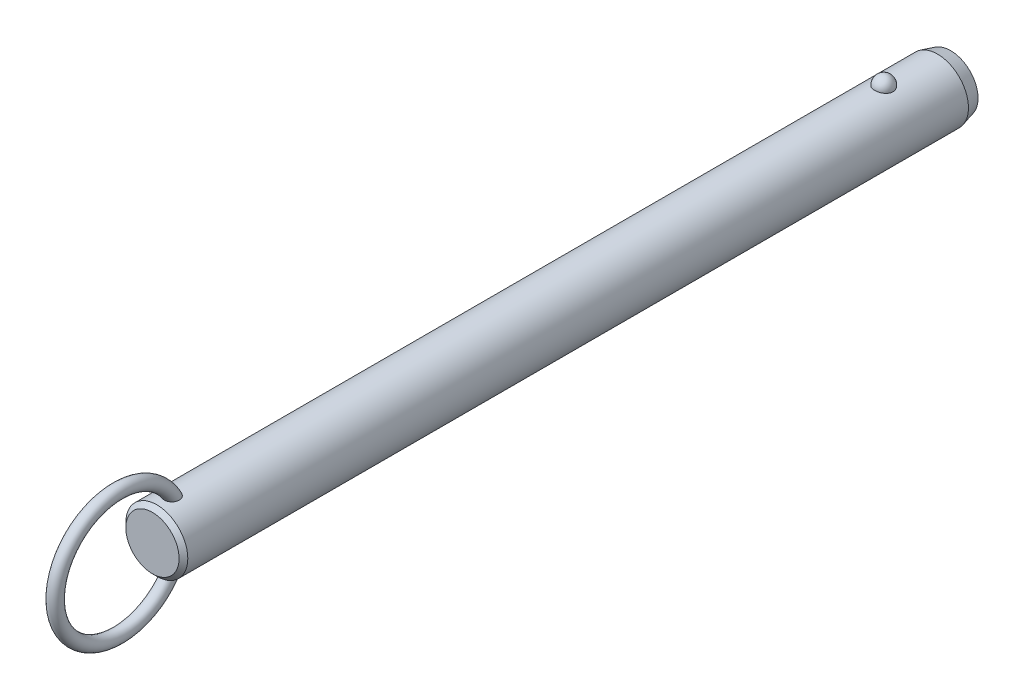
ISO-10303-21;
HEADER;
FILE_DESCRIPTION(('STEP AP214'),'2;1');
FILE_NAME('part.step','',(''),(''),'','','');
FILE_SCHEMA(('AUTOMOTIVE_DESIGN { 1 0 10303 214 1 1 1 1 }'));
ENDSEC;
DATA;
#1=APPLICATION_CONTEXT('core data for automotive mechanical design processes');
#2=APPLICATION_PROTOCOL_DEFINITION('international standard','automotive_design',2000,#1);
#3=PRODUCT_CONTEXT('',#1,'mechanical');
#4=PRODUCT('Part','Part','',(#3));
#5=PRODUCT_RELATED_PRODUCT_CATEGORY('part','',(#4));
#6=PRODUCT_DEFINITION_FORMATION('','',#4);
#7=PRODUCT_DEFINITION_CONTEXT('part definition',#1,'design');
#8=PRODUCT_DEFINITION('design','',#6,#7);
#9=PRODUCT_DEFINITION_SHAPE('','',#8);
#10=(LENGTH_UNIT() NAMED_UNIT(*) SI_UNIT(.MILLI.,.METRE.));
#11=(NAMED_UNIT(*) PLANE_ANGLE_UNIT() SI_UNIT($,.RADIAN.));
#12=(NAMED_UNIT(*) SI_UNIT($,.STERADIAN.) SOLID_ANGLE_UNIT());
#13=UNCERTAINTY_MEASURE_WITH_UNIT(LENGTH_MEASURE(1.E-05),#10,'distance_accuracy_value','');
#14=(GEOMETRIC_REPRESENTATION_CONTEXT(3) GLOBAL_UNCERTAINTY_ASSIGNED_CONTEXT((#13)) GLOBAL_UNIT_ASSIGNED_CONTEXT((#10,
#11,#12)) REPRESENTATION_CONTEXT('',''));
#15=CARTESIAN_POINT('',(0.,0.,0.));
#16=DIRECTION('',(0.,0.,1.));
#17=DIRECTION('',(1.,0.,0.));
#18=AXIS2_PLACEMENT_3D('',#15,#16,#17);
#19=CARTESIAN_POINT('',(0.,0.,157.5));
#20=DIRECTION('',(0.,0.,-1.));
#21=DIRECTION('',(-1.,0.,0.));
#22=AXIS2_PLACEMENT_3D('',#19,#20,#21);
#23=CYLINDRICAL_SURFACE('',#22,7.1);
#24=CARTESIAN_POINT('',(2.0769088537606,6.78943661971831,-2.1));
#25=CARTESIAN_POINT('',(2.07690739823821,6.78943796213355,-1.98268154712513));
#26=CARTESIAN_POINT('',(2.06738130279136,6.79237331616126,-1.86534506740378));
#27=CARTESIAN_POINT('',(2.0295040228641,6.8037853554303,-1.63400788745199));
#28=CARTESIAN_POINT('',(2.00114757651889,6.81226358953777,-1.52000812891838));
#29=CARTESIAN_POINT('',(1.92632025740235,6.83379798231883,-1.29863433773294));
#30=CARTESIAN_POINT('',(1.87985726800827,6.84685214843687,-1.19125744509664));
#31=CARTESIAN_POINT('',(1.76995205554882,6.87608091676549,-0.98604657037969));
#32=CARTESIAN_POINT('',(1.70650980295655,6.8922555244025,-0.88821260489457));
#33=CARTESIAN_POINT('',(1.5638119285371,6.92602930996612,-0.704242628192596));
#34=CARTESIAN_POINT('',(1.4844714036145,6.94363582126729,-0.618173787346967));
#35=CARTESIAN_POINT('',(1.31221746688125,6.97823658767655,-0.460740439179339));
#36=CARTESIAN_POINT('',(1.21930409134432,6.99523084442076,-0.389375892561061));
#37=CARTESIAN_POINT('',(1.02268781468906,7.02666176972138,-0.263547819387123));
#38=CARTESIAN_POINT('',(0.91902009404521,7.04110638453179,-0.209031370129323));
#39=CARTESIAN_POINT('',(0.703548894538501,7.06588726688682,-0.118163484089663));
#40=CARTESIAN_POINT('',(0.591746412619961,7.07622403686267,-0.0818098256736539));
#41=CARTESIAN_POINT('',(0.365557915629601,7.09147068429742,-0.0288711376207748));
#42=CARTESIAN_POINT('',(0.251267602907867,7.09648447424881,-0.0119070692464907));
#43=CARTESIAN_POINT('',(0.0213499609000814,7.10089837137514,0.00304925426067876));
#44=CARTESIAN_POINT('',(-0.0942772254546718,7.10029907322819,0.00104351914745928));
#45=CARTESIAN_POINT('',(-0.321651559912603,7.09360829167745,-0.0216931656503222));
#46=CARTESIAN_POINT('',(-0.433431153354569,7.08760388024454,-0.0421272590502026));
#47=CARTESIAN_POINT('',(-0.651862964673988,7.07086131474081,-0.100729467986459));
#48=CARTESIAN_POINT('',(-0.758515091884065,7.06012307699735,-0.138897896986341));
#49=CARTESIAN_POINT('',(-0.964449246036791,7.03496097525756,-0.232213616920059));
#50=CARTESIAN_POINT('',(-1.06368095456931,7.02051445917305,-0.287465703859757));
#51=CARTESIAN_POINT('',(-1.25145353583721,6.98948740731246,-0.413383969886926));
#52=CARTESIAN_POINT('',(-1.33999321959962,6.97290663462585,-0.48405186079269));
#53=CARTESIAN_POINT('',(-1.50591604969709,6.93898770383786,-0.640594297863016));
#54=CARTESIAN_POINT('',(-1.58302488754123,6.92164094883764,-0.726757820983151));
#55=CARTESIAN_POINT('',(-1.72189320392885,6.8884103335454,-0.91092752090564));
#56=CARTESIAN_POINT('',(-1.78365144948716,6.87252659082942,-1.008934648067));
#57=CARTESIAN_POINT('',(-1.89101272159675,6.84377189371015,-1.21549497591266));
#58=CARTESIAN_POINT('',(-1.93639553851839,6.83094274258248,-1.32416860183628));
#59=CARTESIAN_POINT('',(-2.00874275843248,6.81002070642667,-1.54791500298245));
#60=CARTESIAN_POINT('',(-2.03570774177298,6.80192767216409,-1.66298757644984));
#61=CARTESIAN_POINT('',(-2.07047276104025,6.7914266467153,-1.89571453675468));
#62=CARTESIAN_POINT('',(-2.07835878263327,6.78899315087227,-2.01335491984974));
#63=CARTESIAN_POINT('',(-2.07502083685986,6.79001409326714,-2.24833570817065));
#64=CARTESIAN_POINT('',(-2.06379746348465,6.7934683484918,-2.36567612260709));
#65=CARTESIAN_POINT('',(-2.02263913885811,6.80583442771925,-2.59603194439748));
#66=CARTESIAN_POINT('',(-1.99281127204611,6.81471501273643,-2.70906820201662));
#67=CARTESIAN_POINT('',(-1.91526639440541,6.83691232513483,-2.92836575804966));
#68=CARTESIAN_POINT('',(-1.8675486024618,6.85022924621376,-3.03462676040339));
#69=CARTESIAN_POINT('',(-1.75504492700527,6.87991336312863,-3.23806487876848));
#70=CARTESIAN_POINT('',(-1.69015924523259,6.89629822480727,-3.33518422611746));
#71=CARTESIAN_POINT('',(-1.54505404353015,6.93024852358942,-3.51697105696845));
#72=CARTESIAN_POINT('',(-1.46483385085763,6.94781401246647,-3.60163799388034));
#73=CARTESIAN_POINT('',(-1.29071406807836,6.98225977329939,-3.75654119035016));
#74=CARTESIAN_POINT('',(-1.19675650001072,6.99913673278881,-3.82671308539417));
#75=CARTESIAN_POINT('',(-0.997940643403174,7.03023618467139,-3.9501837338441));
#76=CARTESIAN_POINT('',(-0.89308318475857,7.04445887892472,-4.00348377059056));
#77=CARTESIAN_POINT('',(-0.676902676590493,7.06848365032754,-4.09107242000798));
#78=CARTESIAN_POINT('',(-0.565686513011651,7.0783430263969,-4.12560889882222));
#79=CARTESIAN_POINT('',(-0.338739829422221,7.09282534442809,-4.17575450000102));
#80=CARTESIAN_POINT('',(-0.223009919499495,7.09744899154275,-4.19136617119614));
#81=CARTESIAN_POINT('',(0.00707628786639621,7.10090930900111,-4.20307965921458));
#82=CARTESIAN_POINT('',(0.121410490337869,7.09986531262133,-4.19958377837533));
#83=CARTESIAN_POINT('',(0.347815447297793,7.092380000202,-4.17411564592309));
#84=CARTESIAN_POINT('',(0.459886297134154,7.08593891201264,-4.15214417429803));
#85=CARTESIAN_POINT('',(0.678084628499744,7.06838983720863,-4.09049562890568));
#86=CARTESIAN_POINT('',(0.784237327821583,7.05730369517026,-4.05090137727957));
#87=CARTESIAN_POINT('',(0.988305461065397,7.03163139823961,-3.95511447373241));
#88=CARTESIAN_POINT('',(1.08622031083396,7.01704499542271,-3.89892064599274));
#89=CARTESIAN_POINT('',(1.27284490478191,6.98562668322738,-3.77035541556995));
#90=CARTESIAN_POINT('',(1.36137372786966,6.96876135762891,-3.69772964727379));
#91=CARTESIAN_POINT('',(1.52509486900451,6.93477412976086,-3.53878279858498));
#92=CARTESIAN_POINT('',(1.60028496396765,6.91765218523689,-3.45245943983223));
#93=CARTESIAN_POINT('',(1.73681688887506,6.88465753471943,-3.26658774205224));
#94=CARTESIAN_POINT('',(1.79785966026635,6.86881574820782,-3.16681408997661));
#95=CARTESIAN_POINT('',(1.90265327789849,6.84053157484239,-2.95814408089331));
#96=CARTESIAN_POINT('',(1.94640861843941,6.82808830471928,-2.84925010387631));
#97=CARTESIAN_POINT('',(2.01274378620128,6.80881460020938,-2.63454318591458));
#98=CARTESIAN_POINT('',(2.03676193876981,6.80160856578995,-2.52920574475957));
#99=CARTESIAN_POINT('',(2.06884490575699,6.79191902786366,-2.3159172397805));
#100=CARTESIAN_POINT('',(2.07691019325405,6.78943538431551,-2.20796625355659));
#101=CARTESIAN_POINT('',(2.0769088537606,6.78943661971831,-2.1));
#102=B_SPLINE_CURVE_WITH_KNOTS('',3,(#24,#25,#26,#27,#28,#29,#30,#31,#32,#33,#34,#35,#36,#37,
#38,#39,#40,#41,#42,#43,#44,#45,#46,#47,#48,#49,#50,#51,#52,#53,#54,#55,#56,#57,#58,#59,#60,#61,
#62,#63,#64,#65,#66,#67,#68,#69,#70,#71,#72,#73,#74,#75,#76,#77,#78,#79,#80,#81,#82,#83,#84,#85,
#86,#87,#88,#89,#90,#91,#92,#93,#94,#95,#96,#97,#98,#99,#100,#101),.UNSPECIFIED.,.T.,.F.,(4,2,2,
2,2,2,2,2,2,2,2,2,2,2,2,2,2,2,2,2,2,2,2,2,2,2,2,2,2,2,2,2,2,2,2,2,2,2,4),(0.,0.351568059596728,
0.703234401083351,1.05474780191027,1.40626181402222,1.75970563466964,2.11314851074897,
2.4654696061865,2.81774759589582,3.16301449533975,3.50824481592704,3.84801136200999,
4.18778391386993,4.52968352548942,4.87162112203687,5.22076181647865,5.56993054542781,
5.92363364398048,6.27732559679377,6.62942052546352,6.98150450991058,7.33158042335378,
7.68167162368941,8.03384443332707,8.38603269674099,8.73975272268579,9.09344583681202,
9.44234545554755,9.79119807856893,10.1327344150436,10.4742563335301,10.8141898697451,
11.1541474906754,11.4997793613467,11.8454687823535,12.1979079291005,12.5502553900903,
12.8738073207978,13.1973496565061),.UNSPECIFIED.);
#103=CARTESIAN_POINT('',(2.0769088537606,6.78943661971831,-2.1));
#104=VERTEX_POINT('',#103);
#105=EDGE_CURVE('E41',#104,#104,#102,.T.);
#106=ORIENTED_EDGE('',*,*,#105,.T.);
#107=EDGE_LOOP('',(#106));
#108=FACE_BOUND('',#107,.T.);
#109=CARTESIAN_POINT('',(0.,0.,164.42));
#110=DIRECTION('',(0.,0.,1.));
#111=DIRECTION('',(1.,0.,0.));
#112=AXIS2_PLACEMENT_3D('',#109,#110,#111);
#113=CIRCLE('',#112,7.1);
#114=CARTESIAN_POINT('',(7.1,0.,164.42));
#115=VERTEX_POINT('',#114);
#116=EDGE_CURVE('E10',#115,#115,#113,.F.);
#117=ORIENTED_EDGE('',*,*,#116,.T.);
#118=EDGE_LOOP('',(#117));
#119=FACE_BOUND('',#118,.T.);
#120=CARTESIAN_POINT('',(-0.429539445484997,-7.08699541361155,159.242921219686));
#121=CARTESIAN_POINT('',(-0.508331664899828,-7.08221999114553,159.266876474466));
#122=CARTESIAN_POINT('',(-0.585039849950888,-7.07624016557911,159.297457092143));
#123=CARTESIAN_POINT('',(-0.73208265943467,-7.06254296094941,159.371024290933));
#124=CARTESIAN_POINT('',(-0.802417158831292,-7.05482554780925,159.414011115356));
#125=CARTESIAN_POINT('',(-0.934722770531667,-7.03851844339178,159.511113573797));
#126=CARTESIAN_POINT('',(-0.996700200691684,-7.02992941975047,159.565220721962));
#127=CARTESIAN_POINT('',(-1.11079942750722,-7.01280697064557,159.682967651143));
#128=CARTESIAN_POINT('',(-1.16292136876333,-7.00427354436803,159.746607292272));
#129=CARTESIAN_POINT('',(-1.25705660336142,-6.98799959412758,159.882687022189));
#130=CARTESIAN_POINT('',(-1.29888032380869,-6.98027525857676,159.955259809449));
#131=CARTESIAN_POINT('',(-1.37069920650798,-6.96652886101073,160.106168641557));
#132=CARTESIAN_POINT('',(-1.40069157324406,-6.96050720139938,160.184506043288));
#133=CARTESIAN_POINT('',(-1.45043507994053,-6.95031881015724,160.350190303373));
#134=CARTESIAN_POINT('',(-1.46937115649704,-6.94630231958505,160.437789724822));
#135=CARTESIAN_POINT('',(-1.49424917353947,-6.94099239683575,160.614871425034));
#136=CARTESIAN_POINT('',(-1.50018601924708,-6.93970003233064,160.704354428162));
#137=CARTESIAN_POINT('',(-1.49978214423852,-6.93978815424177,160.894060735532));
#138=CARTESIAN_POINT('',(-1.49187639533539,-6.94150934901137,160.994279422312));
#139=CARTESIAN_POINT('',(-1.46177925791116,-6.94790814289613,161.192479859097));
#140=CARTESIAN_POINT('',(-1.43957541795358,-6.95258831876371,161.290459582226));
#141=CARTESIAN_POINT('',(-1.37783293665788,-6.96510647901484,161.49536292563));
#142=CARTESIAN_POINT('',(-1.33634073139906,-6.97328848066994,161.601680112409));
#143=CARTESIAN_POINT('',(-1.23686994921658,-6.99161706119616,161.806177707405));
#144=CARTESIAN_POINT('',(-1.17889192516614,-7.00176357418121,161.904358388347));
#145=CARTESIAN_POINT('',(-1.05875124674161,-7.02082898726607,162.072374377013));
#146=CARTESIAN_POINT('',(-0.999247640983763,-7.02963746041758,162.144123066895));
#147=CARTESIAN_POINT('',(-0.869494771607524,-7.04686074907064,162.277195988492));
#148=CARTESIAN_POINT('',(-0.799263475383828,-7.05527619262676,162.338537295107));
#149=CARTESIAN_POINT('',(-0.665408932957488,-7.06899457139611,162.435131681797));
#150=CARTESIAN_POINT('',(-0.603817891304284,-7.07457275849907,162.473151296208));
#151=CARTESIAN_POINT('',(-0.475172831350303,-7.08437420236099,162.538758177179));
#152=CARTESIAN_POINT('',(-0.408123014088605,-7.08859848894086,162.566353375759));
#153=CARTESIAN_POINT('',(-0.269431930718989,-7.09522749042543,162.609256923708));
#154=CARTESIAN_POINT('',(-0.197757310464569,-7.09761688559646,162.624461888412));
#155=CARTESIAN_POINT('',(-0.0527849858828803,-7.10017268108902,162.640716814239));
#156=CARTESIAN_POINT('',(0.0205115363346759,-7.10034065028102,162.641776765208));
#157=CARTESIAN_POINT('',(0.156426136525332,-7.09855986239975,162.630461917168));
#158=CARTESIAN_POINT('',(0.219199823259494,-7.09688191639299,162.619806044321));
#159=CARTESIAN_POINT('',(0.342134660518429,-7.09201880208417,162.588537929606));
#160=CARTESIAN_POINT('',(0.402295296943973,-7.08883333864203,162.567923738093));
#161=CARTESIAN_POINT('',(0.520687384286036,-7.08113868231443,162.517212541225));
#162=CARTESIAN_POINT('',(0.578791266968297,-7.07658958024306,162.486827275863));
#163=CARTESIAN_POINT('',(0.690173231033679,-7.06659708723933,162.418367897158));
#164=CARTESIAN_POINT('',(0.743447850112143,-7.061153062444,162.380288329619));
#165=CARTESIAN_POINT('',(0.870947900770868,-7.04680292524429,162.276592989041));
#166=CARTESIAN_POINT('',(0.941828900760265,-7.03755800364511,162.206897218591));
#167=CARTESIAN_POINT('',(1.07136606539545,-7.01900793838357,162.056945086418));
#168=CARTESIAN_POINT('',(1.13000013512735,-7.00970271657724,161.976670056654));
#169=CARTESIAN_POINT('',(1.23579584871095,-6.99183327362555,161.806899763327));
#170=CARTESIAN_POINT('',(1.28274271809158,-6.98328455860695,161.717269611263));
#171=CARTESIAN_POINT('',(1.36351442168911,-6.96796352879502,161.532176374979));
#172=CARTESIAN_POINT('',(1.39733971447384,-6.96119115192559,161.436713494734));
#173=CARTESIAN_POINT('',(1.45579181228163,-6.94922464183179,161.22530928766));
#174=CARTESIAN_POINT('',(1.47790145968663,-6.94449000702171,161.108631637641));
#175=CARTESIAN_POINT('',(1.50168752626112,-6.93938731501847,160.873015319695));
#176=CARTESIAN_POINT('',(1.50336085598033,-6.93901991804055,160.75407631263));
#177=CARTESIAN_POINT('',(1.48486516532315,-6.9430010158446,160.52360799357));
#178=CARTESIAN_POINT('',(1.46573441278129,-6.9471253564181,160.411995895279));
#179=CARTESIAN_POINT('',(1.40606892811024,-6.95944667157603,160.194886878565));
#180=CARTESIAN_POINT('',(1.36556446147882,-6.96763788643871,160.0893815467));
#181=CARTESIAN_POINT('',(1.2708270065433,-6.98548038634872,159.904287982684));
#182=CARTESIAN_POINT('',(1.21949810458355,-6.99473841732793,159.823171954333));
#183=CARTESIAN_POINT('',(1.10242050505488,-7.01414069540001,159.672227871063));
#184=CARTESIAN_POINT('',(1.03668119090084,-7.02428436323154,159.60239252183));
#185=CARTESIAN_POINT('',(0.900559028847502,-7.04295285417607,159.483573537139));
#186=CARTESIAN_POINT('',(0.831428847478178,-7.05153466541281,159.433157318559));
#187=CARTESIAN_POINT('',(0.685291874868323,-7.06723150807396,159.345142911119));
#188=CARTESIAN_POINT('',(0.608287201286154,-7.07434693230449,159.307541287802));
#189=CARTESIAN_POINT('',(0.451878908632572,-7.08602232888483,159.247491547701));
#190=CARTESIAN_POINT('',(0.372686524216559,-7.09067127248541,159.224508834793));
#191=CARTESIAN_POINT('',(0.21147739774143,-7.09730788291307,159.192035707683));
#192=CARTESIAN_POINT('',(0.129460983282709,-7.09929585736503,159.18254373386));
#193=CARTESIAN_POINT('',(-0.0332905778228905,-7.10037858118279,159.177351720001));
#194=CARTESIAN_POINT('',(-0.114016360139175,-7.09953334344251,159.181365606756));
#195=CARTESIAN_POINT('',(-0.273670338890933,-7.09517338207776,159.202454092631));
#196=CARTESIAN_POINT('',(-0.352598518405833,-7.09165863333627,159.219528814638));
#197=CARTESIAN_POINT('',(-0.429539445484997,-7.08699541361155,159.242921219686));
#198=B_SPLINE_CURVE_WITH_KNOTS('',3,(#120,#121,#122,#123,#124,#125,#126,#127,#128,#129,#130,
#131,#132,#133,#134,#135,#136,#137,#138,#139,#140,#141,#142,#143,#144,#145,#146,#147,#148,#149,
#150,#151,#152,#153,#154,#155,#156,#157,#158,#159,#160,#161,#162,#163,#164,#165,#166,#167,#168,
#169,#170,#171,#172,#173,#174,#175,#176,#177,#178,#179,#180,#181,#182,#183,#184,#185,#186,#187,
#188,#189,#190,#191,#192,#193,#194,#195,#196,#197),.UNSPECIFIED.,.T.,.F.,(4,2,2,2,2,2,2,2,2,2,2,
2,2,2,2,2,2,2,2,2,2,2,2,2,2,2,2,2,2,2,2,2,2,2,2,2,2,2,4),(0.,0.247183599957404,
0.494372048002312,0.741372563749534,0.988369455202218,1.23962059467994,1.490931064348,
1.75897818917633,2.02713035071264,2.32758265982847,2.62829697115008,2.97008736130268,
3.31186629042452,3.59175319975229,3.87117637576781,4.08813841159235,4.30493502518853,
4.5235225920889,4.74195577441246,4.93215328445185,5.12238804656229,5.31884850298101,
5.51544871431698,5.81332317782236,6.11173048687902,6.41527266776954,6.71880423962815,
7.07358156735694,7.42841252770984,7.76631485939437,8.10373999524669,8.39142246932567,
8.67891817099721,8.93560332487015,9.19221962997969,9.43881106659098,9.68537399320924,
9.92674752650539,10.1681233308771),.UNSPECIFIED.);
#199=CARTESIAN_POINT('',(-0.429539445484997,-7.08699541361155,159.242921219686));
#200=VERTEX_POINT('',#199);
#201=EDGE_CURVE('E59',#200,#200,#198,.T.);
#202=ORIENTED_EDGE('',*,*,#201,.T.);
#203=EDGE_LOOP('',(#202));
#204=FACE_BOUND('',#203,.T.);
#205=CARTESIAN_POINT('',(-0.429539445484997,7.08699541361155,159.242921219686));
#206=CARTESIAN_POINT('',(-0.351665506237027,7.09171429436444,159.219246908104));
#207=CARTESIAN_POINT('',(-0.271733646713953,7.09525896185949,159.202036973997));
#208=CARTESIAN_POINT('',(-0.110026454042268,7.09960839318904,159.181005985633));
#209=CARTESIAN_POINT('',(-0.0282502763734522,7.10041187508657,159.177191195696));
#210=CARTESIAN_POINT('',(0.134782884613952,7.09918849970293,159.183059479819));
#211=CARTESIAN_POINT('',(0.216039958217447,7.09716214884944,159.19274013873));
#212=CARTESIAN_POINT('',(0.375730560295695,7.09050177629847,159.225347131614));
#213=CARTESIAN_POINT('',(0.454164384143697,7.08586802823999,159.248272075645));
#214=CARTESIAN_POINT('',(0.606025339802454,7.07449911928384,159.306771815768));
#215=CARTESIAN_POINT('',(0.67945100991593,7.06776334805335,159.342350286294));
#216=CARTESIAN_POINT('',(0.819234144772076,7.05292866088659,159.425175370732));
#217=CARTESIAN_POINT('',(0.88559181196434,7.04482978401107,159.472421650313));
#218=CARTESIAN_POINT('',(1.00993211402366,7.02808709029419,159.577590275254));
#219=CARTESIAN_POINT('',(1.06785399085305,7.01943990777,159.635583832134));
#220=CARTESIAN_POINT('',(1.17342527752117,7.00256662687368,159.760301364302));
#221=CARTESIAN_POINT('',(1.22107408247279,6.99434055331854,159.827025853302));
#222=CARTESIAN_POINT('',(1.30652927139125,6.97889183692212,159.969362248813));
#223=CARTESIAN_POINT('',(1.34399711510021,6.97170674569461,160.045180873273));
#224=CARTESIAN_POINT('',(1.40682616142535,6.95930080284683,160.201810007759));
#225=CARTESIAN_POINT('',(1.43218374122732,6.95408053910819,160.28262200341));
#226=CARTESIAN_POINT('',(1.47246409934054,6.94566853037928,160.453531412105));
#227=CARTESIAN_POINT('',(1.48642590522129,6.9426653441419,160.54386307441));
#228=CARTESIAN_POINT('',(1.5011410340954,6.93949744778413,160.725619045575));
#229=CARTESIAN_POINT('',(1.50188917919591,6.93933385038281,160.817043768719));
#230=CARTESIAN_POINT('',(1.49030464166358,6.94183245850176,161.01084381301));
#231=CARTESIAN_POINT('',(1.47627413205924,6.94486147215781,161.113112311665));
#232=CARTESIAN_POINT('',(1.43356351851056,6.95380194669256,161.314471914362));
#233=CARTESIAN_POINT('',(1.4048676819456,6.95971650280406,161.413559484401));
#234=CARTESIAN_POINT('',(1.32908750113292,6.97461208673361,161.618908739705));
#235=CARTESIAN_POINT('',(1.28011435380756,6.98388945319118,161.724456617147));
#236=CARTESIAN_POINT('',(1.16520357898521,7.00397743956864,161.925760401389));
#237=CARTESIAN_POINT('',(1.09927694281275,7.01478706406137,162.021522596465));
#238=CARTESIAN_POINT('',(0.969361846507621,7.03373936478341,162.176756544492));
#239=CARTESIAN_POINT('',(0.909042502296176,7.04187023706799,162.239303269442));
#240=CARTESIAN_POINT('',(0.779178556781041,7.05741732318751,162.354053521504));
#241=CARTESIAN_POINT('',(0.709649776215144,7.06483472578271,162.406274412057));
#242=CARTESIAN_POINT('',(0.576854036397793,7.0767751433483,162.488113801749));
#243=CARTESIAN_POINT('',(0.515118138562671,7.08158033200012,162.520164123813));
#244=CARTESIAN_POINT('',(0.387127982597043,7.08972701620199,162.573765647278));
#245=CARTESIAN_POINT('',(0.320877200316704,7.09306962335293,162.595324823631));
#246=CARTESIAN_POINT('',(0.185041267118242,7.09791507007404,162.626400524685));
#247=CARTESIAN_POINT('',(0.115437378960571,7.09940591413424,162.635838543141));
#248=CARTESIAN_POINT('',(-0.0243157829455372,7.10030171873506,162.641522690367));
#249=CARTESIAN_POINT('',(-0.0944648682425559,7.0997073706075,162.637773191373));
#250=CARTESIAN_POINT('',(-0.225713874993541,7.09668414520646,162.618508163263));
#251=CARTESIAN_POINT('',(-0.287006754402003,7.09444865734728,162.604232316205));
#252=CARTESIAN_POINT('',(-0.406555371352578,7.08860360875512,162.566368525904));
#253=CARTESIAN_POINT('',(-0.464809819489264,7.08499346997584,162.542776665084));
#254=CARTESIAN_POINT('',(-0.594955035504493,7.07541654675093,162.478923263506));
#255=CARTESIAN_POINT('',(-0.665389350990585,7.06906574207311,162.435753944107));
#256=CARTESIAN_POINT('',(-0.798242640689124,7.05530261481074,162.338587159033));
#257=CARTESIAN_POINT('',(-0.860645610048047,7.0478882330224,162.284568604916));
#258=CARTESIAN_POINT('',(-0.994249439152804,7.03045217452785,162.150996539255));
#259=CARTESIAN_POINT('',(-1.06260129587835,7.02030745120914,162.068614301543));
#260=CARTESIAN_POINT('',(-1.18502045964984,7.00068382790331,161.893843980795));
#261=CARTESIAN_POINT('',(-1.23907684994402,6.99120544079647,161.801448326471));
#262=CARTESIAN_POINT('',(-1.33335589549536,6.97384343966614,161.608008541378));
#263=CARTESIAN_POINT('',(-1.37336138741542,6.96598557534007,161.506856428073));
#264=CARTESIAN_POINT('',(-1.43770677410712,6.95299053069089,161.299504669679));
#265=CARTESIAN_POINT('',(-1.46204473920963,6.94785368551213,161.19330440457));
#266=CARTESIAN_POINT('',(-1.49537533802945,6.94076296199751,160.968231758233));
#267=CARTESIAN_POINT('',(-1.50273564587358,6.93914842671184,160.84909751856));
#268=CARTESIAN_POINT('',(-1.4954555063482,6.94072368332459,160.611470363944));
#269=CARTESIAN_POINT('',(-1.48082914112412,6.94391040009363,160.492977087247));
#270=CARTESIAN_POINT('',(-1.43076401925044,6.95438579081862,160.273432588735));
#271=CARTESIAN_POINT('',(-1.3976222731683,6.96121852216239,160.171841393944));
#272=CARTESIAN_POINT('',(-1.31211274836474,6.97783941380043,159.977351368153));
#273=CARTESIAN_POINT('',(-1.25976607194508,6.98762432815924,159.88444313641));
#274=CARTESIAN_POINT('',(-1.14583073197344,7.00713153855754,159.724160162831));
#275=CARTESIAN_POINT('',(-1.08665947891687,7.01665982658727,159.655035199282));
#276=CARTESIAN_POINT('',(-0.95660664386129,7.03556646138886,159.528878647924));
#277=CARTESIAN_POINT('',(-0.885737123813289,7.04494495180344,159.471834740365));
#278=CARTESIAN_POINT('',(-0.751558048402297,7.06035735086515,159.383100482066));
#279=CARTESIAN_POINT('',(-0.69012057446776,7.0666695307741,159.348593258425));
#280=CARTESIAN_POINT('',(-0.562815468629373,7.07794609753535,159.288750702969));
#281=CARTESIAN_POINT('',(-0.496948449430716,7.08291067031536,159.263414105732));
#282=CARTESIAN_POINT('',(-0.429539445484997,7.08699541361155,159.242921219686));
#283=B_SPLINE_CURVE_WITH_KNOTS('',3,(#205,#206,#207,#208,#209,#210,#211,#212,#213,#214,#215,
#216,#217,#218,#219,#220,#221,#222,#223,#224,#225,#226,#227,#228,#229,#230,#231,#232,#233,#234,
#235,#236,#237,#238,#239,#240,#241,#242,#243,#244,#245,#246,#247,#248,#249,#250,#251,#252,#253,
#254,#255,#256,#257,#258,#259,#260,#261,#262,#263,#264,#265,#266,#267,#268,#269,#270,#271,#272,
#273,#274,#275,#276,#277,#278,#279,#280,#281,#282),.UNSPECIFIED.,.T.,.F.,(4,2,2,2,2,2,2,2,2,2,2,
2,2,2,2,2,2,2,2,2,2,2,2,2,2,2,2,2,2,2,2,2,2,2,2,2,2,2,4),(0.,0.244335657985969,
0.488785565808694,0.733191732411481,0.977572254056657,1.2220237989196,1.46646834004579,
1.71259457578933,1.9587352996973,2.21226768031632,2.46587585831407,2.73913816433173,
3.01250754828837,3.32109936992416,3.63002293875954,3.9786351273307,4.32702187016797,
4.58793945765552,4.84841449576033,5.05676704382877,5.26496096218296,5.47449661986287,
5.68396281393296,5.87205447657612,6.06022532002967,6.30743751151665,6.55513496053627,
6.87602468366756,7.1971587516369,7.52305774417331,7.84899686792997,8.2051615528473,
8.56109821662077,8.88040084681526,9.19935367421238,9.47236282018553,9.74509220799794,
9.95662250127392,10.1681235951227),.UNSPECIFIED.);
#284=CARTESIAN_POINT('',(-0.429539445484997,7.08699541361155,159.242921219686));
#285=VERTEX_POINT('',#284);
#286=EDGE_CURVE('E66',#285,#285,#283,.T.);
#287=ORIENTED_EDGE('',*,*,#286,.T.);
#288=EDGE_LOOP('',(#287));
#289=FACE_BOUND('',#288,.T.);
#290=CARTESIAN_POINT('',(0.,0.,-14.4));
#291=DIRECTION('',(0.,0.,-1.));
#292=DIRECTION('',(-1.,0.,0.));
#293=AXIS2_PLACEMENT_3D('',#290,#291,#292);
#294=CIRCLE('',#293,7.1);
#295=CARTESIAN_POINT('',(-7.1,0.,-14.4));
#296=VERTEX_POINT('',#295);
#297=EDGE_CURVE('E56',#296,#296,#294,.F.);
#298=ORIENTED_EDGE('',*,*,#297,.T.);
#299=EDGE_LOOP('',(#298));
#300=FACE_BOUND('',#299,.T.);
#301=ADVANCED_FACE('F37',(#108,#119,#204,#289,#300),#23,.T.);
#302=CARTESIAN_POINT('',(0.,0.,-17.4));
#303=DIRECTION('',(0.,0.,-1.));
#304=DIRECTION('',(-1.,0.,0.));
#305=AXIS2_PLACEMENT_3D('',#302,#303,#304);
#306=PLANE('',#305);
#307=CARTESIAN_POINT('',(0.,0.,-17.4));
#308=DIRECTION('',(0.,0.,-1.));
#309=DIRECTION('',(-1.,0.,0.));
#310=AXIS2_PLACEMENT_3D('',#307,#308,#309);
#311=CIRCLE('',#310,6.29615242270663);
#312=CARTESIAN_POINT('',(-6.29615242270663,0.,-17.4));
#313=VERTEX_POINT('',#312);
#314=EDGE_CURVE('E65',#313,#313,#311,.T.);
#315=ORIENTED_EDGE('',*,*,#314,.T.);
#316=EDGE_LOOP('',(#315));
#317=FACE_BOUND('',#316,.T.);
#318=ADVANCED_FACE('F84',(#317),#306,.T.);
#319=CARTESIAN_POINT('',(0.,0.,-17.4));
#320=DIRECTION('',(0.,0.,1.));
#321=DIRECTION('',(1.,0.,0.));
#322=AXIS2_PLACEMENT_3D('',#319,#320,#321);
#323=CONICAL_SURFACE('',#322,6.29615242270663,0.261799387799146);
#324=ORIENTED_EDGE('',*,*,#297,.F.);
#325=EDGE_LOOP('',(#324));
#326=FACE_BOUND('',#325,.T.);
#327=ORIENTED_EDGE('',*,*,#314,.F.);
#328=EDGE_LOOP('',(#327));
#329=FACE_BOUND('',#328,.T.);
#330=ADVANCED_FACE('F82',(#326,#329),#323,.T.);
#331=CARTESIAN_POINT('',(0.,0.,165.42));
#332=DIRECTION('',(0.,0.,1.));
#333=DIRECTION('',(1.,0.,0.));
#334=AXIS2_PLACEMENT_3D('',#331,#332,#333);
#335=PLANE('',#334);
#336=CARTESIAN_POINT('',(0.,0.,165.42));
#337=DIRECTION('',(0.,0.,1.));
#338=DIRECTION('',(1.,0.,0.));
#339=AXIS2_PLACEMENT_3D('',#336,#337,#338);
#340=CIRCLE('',#339,6.10000000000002);
#341=CARTESIAN_POINT('',(6.10000000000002,0.,165.42));
#342=VERTEX_POINT('',#341);
#343=EDGE_CURVE('E50',#342,#342,#340,.T.);
#344=ORIENTED_EDGE('',*,*,#343,.T.);
#345=EDGE_LOOP('',(#344));
#346=FACE_BOUND('',#345,.T.);
#347=ADVANCED_FACE('F76',(#346),#335,.T.);
#348=CARTESIAN_POINT('',(0.,0.,173.35));
#349=DIRECTION('',(1.,0.,0.));
#350=DIRECTION('',(0.,0.,-1.));
#351=AXIS2_PLACEMENT_3D('',#348,#349,#350);
#352=TOROIDAL_SURFACE('',#351,14.35,1.5);
#353=ORIENTED_EDGE('',*,*,#286,.F.);
#354=EDGE_LOOP('',(#353));
#355=FACE_BOUND('',#354,.T.);
#356=ORIENTED_EDGE('',*,*,#201,.F.);
#357=EDGE_LOOP('',(#356));
#358=FACE_BOUND('',#357,.T.);
#359=ADVANCED_FACE('F72',(#355,#358),#352,.T.);
#360=CARTESIAN_POINT('',(0.,0.,165.42));
#361=DIRECTION('',(0.,0.,-1.));
#362=DIRECTION('',(-1.,0.,0.));
#363=AXIS2_PLACEMENT_3D('',#360,#361,#362);
#364=CONICAL_SURFACE('',#363,6.10000000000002,0.78539816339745);
#365=ORIENTED_EDGE('',*,*,#116,.F.);
#366=EDGE_LOOP('',(#365));
#367=FACE_BOUND('',#366,.T.);
#368=ORIENTED_EDGE('',*,*,#343,.F.);
#369=EDGE_LOOP('',(#368));
#370=FACE_BOUND('',#369,.T.);
#371=ADVANCED_FACE('F39',(#367,#370),#364,.T.);
#372=CARTESIAN_POINT('',(0.,7.1,-2.1));
#373=DIRECTION('',(0.,1.,0.));
#374=DIRECTION('',(0.,0.,1.));
#375=AXIS2_PLACEMENT_3D('',#372,#373,#374);
#376=SPHERICAL_SURFACE('',#375,2.10000000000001);
#377=ORIENTED_EDGE('',*,*,#105,.F.);
#378=EDGE_LOOP('',(#377));
#379=FACE_BOUND('',#378,.T.);
#380=ADVANCED_FACE('F78',(#379),#376,.T.);
#381=CLOSED_SHELL('',(#301,#318,#330,#347,#359,#371,#380));
#382=MANIFOLD_SOLID_BREP('B2',#381);
#383=ADVANCED_BREP_SHAPE_REPRESENTATION('',(#18,#382),#14);
#384=SHAPE_DEFINITION_REPRESENTATION(#9,#383);
ENDSEC;
END-ISO-10303-21;
